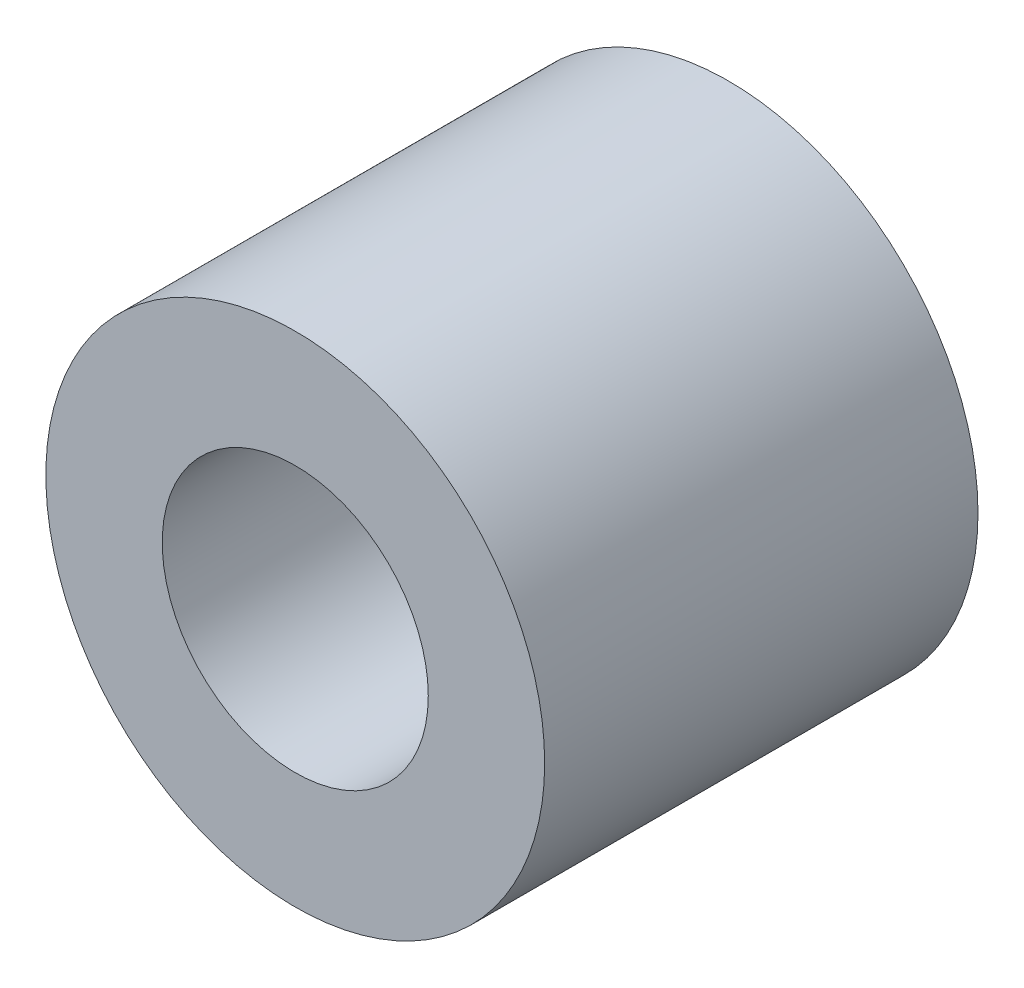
from build123d import *

# Parameters (mm, degrees)
CROQUIS1_R              = 7.5
CROQUIS1_R_2            = 4
SALIENTE_EXTRUIR1_DEPTH = 6.515


with BuildPart() as part:
    # Croquis1 → Saliente-Extruir1 (new, symmetric)
    with BuildSketch(Plane.XY):
        Circle(CROQUIS1_R)
        Circle(CROQUIS1_R_2, mode=Mode.SUBTRACT)
    extrude(amount=SALIENTE_EXTRUIR1_DEPTH, both=True)


solid = part.part
